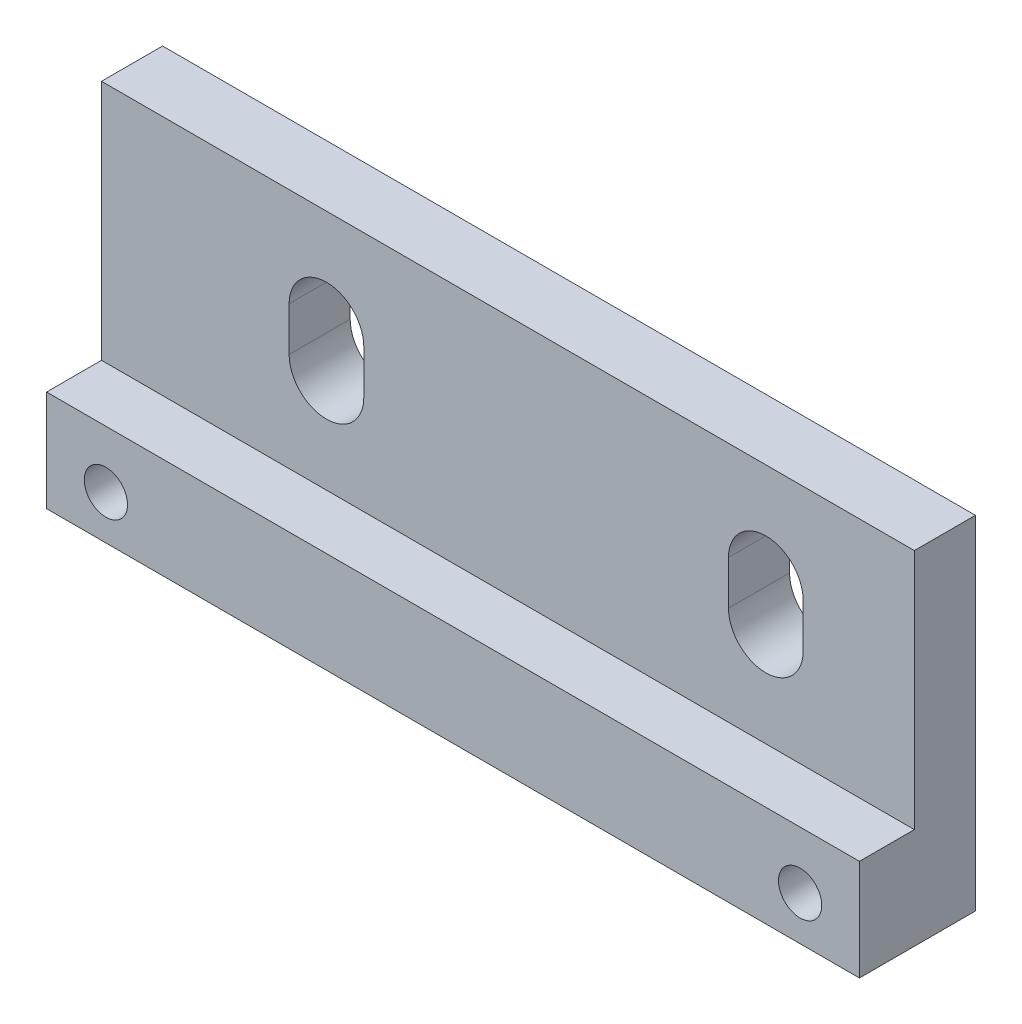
from build123d import *

# Parameters (mm, degrees)
SKETCH1_W             = 46.99
SKETCH1_H             = 19.812
EXTRUDE1_DEPTH        = 6.7056
CUT_EXTRUDE1_REACH    = 50.489
SKETCH2_W             = 3.175
SKETCH2_H             = 13.97
M3X0_5_TAPPED_HOLE1_D = 2.5
CUT_EXTRUDE2_DEPTH    = 26.741192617


with BuildPart() as part:
    # Sketch1 → Extrude1 (new body)
    with BuildSketch(Plane.XY):
        Rectangle(SKETCH1_W, SKETCH1_H)
    extrude(amount=EXTRUDE1_DEPTH)

    # Sketch2 → Cut-Extrude1 (cut, up to next)
    with BuildSketch(Plane(origin=(23.495, 0, 0), x_dir=(0, 0, -1), z_dir=(1, 0, 0)), mode=Mode.PRIVATE) as cut_extrude1_sk1:
        with Locations((-5.1181, 2.921)):
            Rectangle(SKETCH2_W, SKETCH2_H)
    cut_extrude1_tool1 = extrude(cut_extrude1_sk1.sketch, amount=-CUT_EXTRUDE1_REACH, mode=Mode.PRIVATE) & part.part
    add(cut_extrude1_tool1.solids().sort_by_distance((23.495, 2.921, 5.1181))[0], mode=Mode.SUBTRACT)

    # M3x0.5 Tapped Hole1 (through all)
    with Locations(Plane(origin=(-20.066, -7.366, 6.7056), x_dir=(1, 0, 0), z_dir=(0, 0, 1))):
        with Locations((0, 0), (40.132, 0)):
            Hole(M3X0_5_TAPPED_HOLE1_D / 2)

    # Sketch4 → Cut-Extrude2 (cut, through all)
    with BuildSketch(Plane.XY.offset(3.5306)):
        with BuildLine():
            Line((-8.3312, 4.191), (-8.3312, 1.651))
            ThreePointArc((-8.3312, 1.651), (-10.4902, -0.508), (-12.6492, 1.651))
            Line((-12.6492, 1.651), (-12.6492, 4.191))
            ThreePointArc((-12.6492, 4.191), (-10.4902, 6.35), (-8.3312, 4.191))
        make_face()
        with BuildLine():
            Line((12.7508, 4.191), (12.7508, 1.651))
            ThreePointArc((12.7508, 1.651), (14.9098, -0.508), (17.0688, 1.651))
            Line((17.0688, 1.651), (17.0688, 4.191))
            ThreePointArc((17.0688, 4.191), (14.9098, 6.35), (12.7508, 4.191))
        make_face()
    extrude(amount=-CUT_EXTRUDE2_DEPTH, mode=Mode.SUBTRACT)


solid = part.part
